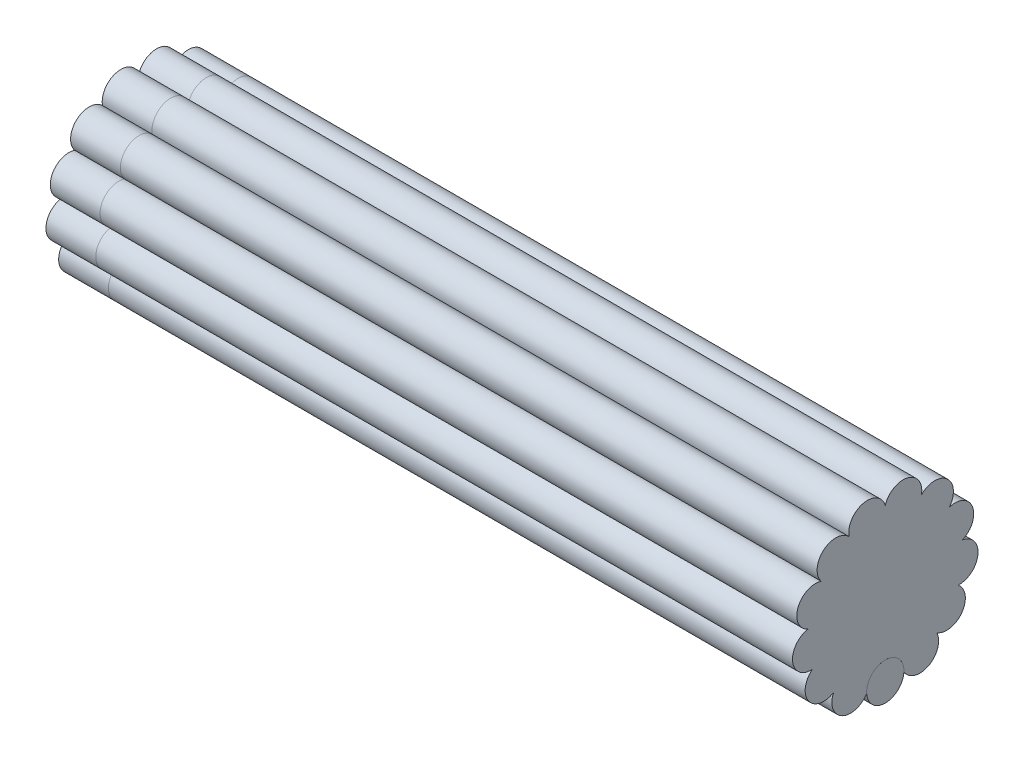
from build123d import *

# Parameters (mm, degrees)
SALIENTE_EXTRUIR1_DEPTH = 280
CROQUIS3_R              = 7.5
SALIENTE_EXTRUIR2_DEPTH = 280
SALIENTE_EXTRUIR3_DEPTH = 20


with BuildPart() as part:
    # Croquis2 → Saliente-Extruir1 (new body)
    with BuildSketch(Plane(origin=(0, 0, 0), x_dir=(0, 0, -1), z_dir=(1, 0, 0))):
        with BuildLine():
            ThreePointArc((7.489959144, -30.387958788), (0, -22.5), (-7.489959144, -30.387958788))
            ThreePointArc((-7.489959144, -30.387958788), (-17.427118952, -33.204600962), (-20.754018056, -23.426443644))
            ThreePointArc((-20.754018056, -23.426443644), (-30.861894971, -21.302428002), (-29.263581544, -11.098212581))
            ThreePointArc((-29.263581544, -11.098212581), (-37.226582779, -4.52012551), (-31.069211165, 3.772485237))
            ThreePointArc((-31.069211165, 3.772485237), (-35.063109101, 13.297683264), (-25.757258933, 17.77895215))
            ThreePointArc((-25.757258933, 17.77895215), (-24.867099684, 28.069153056), (-14.544629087, 27.712475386))
            ThreePointArc((-14.544629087, 27.712475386), (-8.974337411, 36.410318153), (0, 31.297404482))
            ThreePointArc((0, 31.297404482), (8.974337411, 36.410318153), (14.544629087, 27.712475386))
            ThreePointArc((14.544629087, 27.712475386), (24.867099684, 28.069153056), (25.757258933, 17.77895215))
            ThreePointArc((25.757258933, 17.77895215), (35.063109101, 13.297683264), (31.069211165, 3.772485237))
            ThreePointArc((31.069211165, 3.772485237), (37.226582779, -4.52012551), (29.263581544, -11.098212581))
            ThreePointArc((29.263581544, -11.098212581), (30.861894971, -21.302428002), (20.754018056, -23.426443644))
            ThreePointArc((20.754018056, -23.426443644), (17.427118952, -33.204600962), (7.489959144, -30.387958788))
        make_face()
    extrude(amount=-SALIENTE_EXTRUIR1_DEPTH)


with BuildPart() as body_2:
    # Croquis3 → Saliente-Extruir2 (new body)
    with BuildSketch(Plane(origin=(0, 0, 0), x_dir=(0, 0, -1), z_dir=(1, 0, 0))):
        with Locations((0, -30)):
            Circle(CROQUIS3_R)
    extrude(amount=-SALIENTE_EXTRUIR2_DEPTH)


with BuildPart() as body_3:
    # Croquis4 → Saliente-Extruir3 (new body)
    with BuildSketch(Plane.ZY.offset(280)):
        with BuildLine():
            ThreePointArc((-7.489959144, -30.387958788), (0, -37.5), (7.489959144, -30.387958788))
            ThreePointArc((7.489959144, -30.387958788), (17.427118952, -33.204600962), (20.754018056, -23.426443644))
            ThreePointArc((20.754018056, -23.426443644), (30.861894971, -21.302428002), (29.263581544, -11.098212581))
            ThreePointArc((29.263581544, -11.098212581), (37.226582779, -4.52012551), (31.069211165, 3.772485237))
            ThreePointArc((31.069211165, 3.772485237), (35.063109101, 13.297683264), (25.757258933, 17.77895215))
            ThreePointArc((25.757258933, 17.77895215), (24.867099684, 28.069153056), (14.544629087, 27.712475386))
            ThreePointArc((14.544629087, 27.712475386), (8.974337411, 36.410318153), (0, 31.297404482))
            ThreePointArc((0, 31.297404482), (-8.974337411, 36.410318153), (-14.544629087, 27.712475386))
            ThreePointArc((-14.544629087, 27.712475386), (-24.867099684, 28.069153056), (-25.757258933, 17.77895215))
            ThreePointArc((-25.757258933, 17.77895215), (-35.063109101, 13.297683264), (-31.069211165, 3.772485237))
            ThreePointArc((-31.069211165, 3.772485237), (-37.226582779, -4.52012551), (-29.263581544, -11.098212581))
            ThreePointArc((-29.263581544, -11.098212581), (-30.861894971, -21.302428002), (-20.754018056, -23.426443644))
            ThreePointArc((-20.754018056, -23.426443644), (-17.427118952, -33.204600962), (-7.489959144, -30.387958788))
        make_face()
    extrude(amount=SALIENTE_EXTRUIR3_DEPTH)


solid = Compound([part.part, body_2.part, body_3.part])
